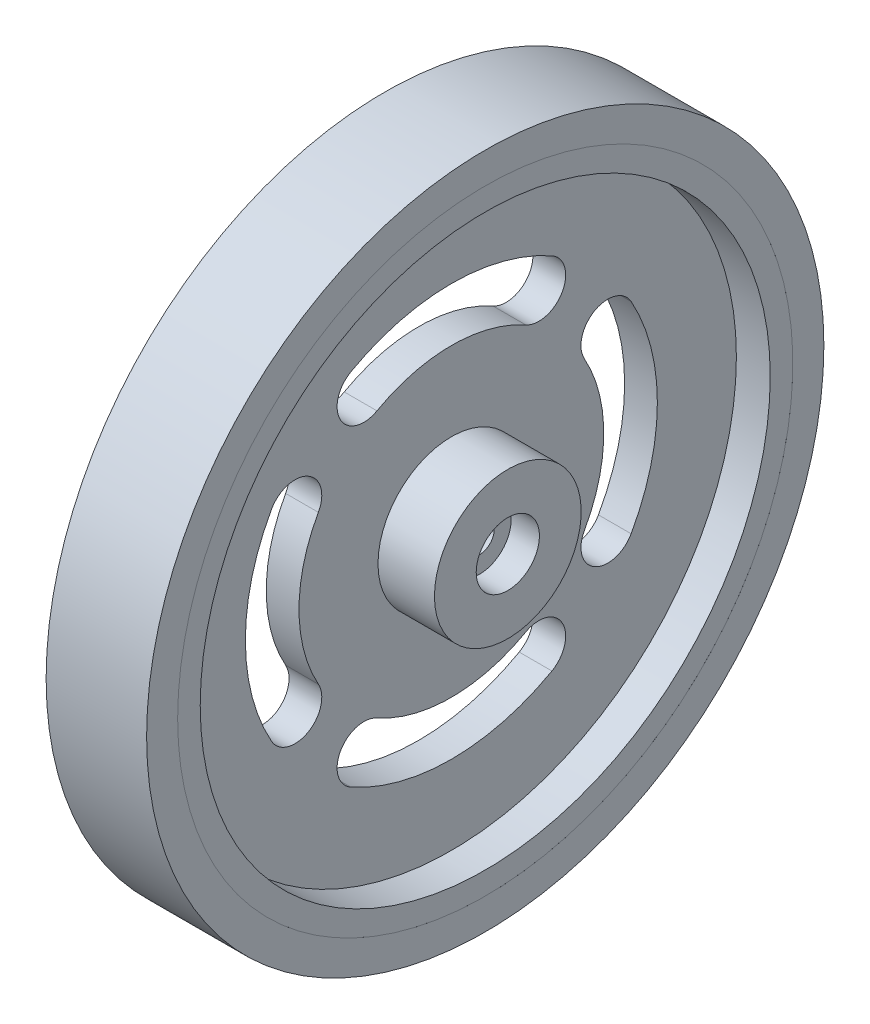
ISO-10303-21;
HEADER;
FILE_DESCRIPTION(('STEP AP214'),'2;1');
FILE_NAME('part.step','',(''),(''),'','','');
FILE_SCHEMA(('AUTOMOTIVE_DESIGN { 1 0 10303 214 1 1 1 1 }'));
ENDSEC;
DATA;
#1=APPLICATION_CONTEXT('core data for automotive mechanical design processes');
#2=APPLICATION_PROTOCOL_DEFINITION('international standard','automotive_design',2000,#1);
#3=PRODUCT_CONTEXT('',#1,'mechanical');
#4=PRODUCT('Part','Part','',(#3));
#5=PRODUCT_RELATED_PRODUCT_CATEGORY('part','',(#4));
#6=PRODUCT_DEFINITION_FORMATION('','',#4);
#7=PRODUCT_DEFINITION_CONTEXT('part definition',#1,'design');
#8=PRODUCT_DEFINITION('design','',#6,#7);
#9=PRODUCT_DEFINITION_SHAPE('','',#8);
#10=(LENGTH_UNIT() NAMED_UNIT(*) SI_UNIT(.MILLI.,.METRE.));
#11=(NAMED_UNIT(*) PLANE_ANGLE_UNIT() SI_UNIT($,.RADIAN.));
#12=(NAMED_UNIT(*) SI_UNIT($,.STERADIAN.) SOLID_ANGLE_UNIT());
#13=UNCERTAINTY_MEASURE_WITH_UNIT(LENGTH_MEASURE(1.E-05),#10,'distance_accuracy_value','');
#14=(GEOMETRIC_REPRESENTATION_CONTEXT(3) GLOBAL_UNCERTAINTY_ASSIGNED_CONTEXT((#13)) GLOBAL_UNIT_ASSIGNED_CONTEXT((#10,
#11,#12)) REPRESENTATION_CONTEXT('',''));
#15=CARTESIAN_POINT('',(0.,0.,0.));
#16=DIRECTION('',(0.,0.,1.));
#17=DIRECTION('',(1.,0.,0.));
#18=AXIS2_PLACEMENT_3D('',#15,#16,#17);
#19=CARTESIAN_POINT('',(-3.,0.,0.));
#20=DIRECTION('',(-1.,0.,0.));
#21=DIRECTION('',(0.,0.,1.));
#22=AXIS2_PLACEMENT_3D('',#19,#20,#21);
#23=CYLINDRICAL_SURFACE('',#22,1.3);
#24=CARTESIAN_POINT('',(5.4,0.,0.));
#25=DIRECTION('',(-1.,0.,0.));
#26=DIRECTION('',(0.,0.,1.));
#27=AXIS2_PLACEMENT_3D('',#24,#25,#26);
#28=CIRCLE('',#27,1.3);
#29=CARTESIAN_POINT('',(5.4,0.,1.3));
#30=VERTEX_POINT('',#29);
#31=EDGE_CURVE('E11',#30,#30,#28,.T.);
#32=ORIENTED_EDGE('',*,*,#31,.F.);
#33=EDGE_LOOP('',(#32));
#34=FACE_BOUND('',#33,.T.);
#35=CARTESIAN_POINT('',(1.2,0.,0.));
#36=DIRECTION('',(-1.,0.,0.));
#37=DIRECTION('',(0.,0.,1.));
#38=AXIS2_PLACEMENT_3D('',#35,#36,#37);
#39=CIRCLE('',#38,1.3);
#40=CARTESIAN_POINT('',(1.2,0.,1.3));
#41=VERTEX_POINT('',#40);
#42=EDGE_CURVE('E40',#41,#41,#39,.T.);
#43=ORIENTED_EDGE('',*,*,#42,.T.);
#44=EDGE_LOOP('',(#43));
#45=FACE_BOUND('',#44,.T.);
#46=ADVANCED_FACE('F37',(#34,#45),#23,.F.);
#47=CARTESIAN_POINT('',(0.,-8.37082020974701,0.));
#48=DIRECTION('',(-1.,0.,0.));
#49=DIRECTION('',(0.,0.,1.));
#50=AXIS2_PLACEMENT_3D('',#47,#48,#49);
#51=PLANE('',#50);
#52=CARTESIAN_POINT('',(0.,-7.75,-13.8547149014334));
#53=DIRECTION('',(-1.,0.,0.));
#54=DIRECTION('',(0.,0.,1.));
#55=AXIS2_PLACEMENT_3D('',#52,#53,#54);
#56=CIRCLE('',#55,2.375);
#57=CARTESIAN_POINT('',(0.,-8.90944881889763,-15.9274675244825));
#58=VERTEX_POINT('',#57);
#59=CARTESIAN_POINT('',(0.,-6.59055118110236,-11.7819622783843));
#60=VERTEX_POINT('',#59);
#61=EDGE_CURVE('E60',#58,#60,#56,.T.);
#62=ORIENTED_EDGE('',*,*,#61,.F.);
#63=CARTESIAN_POINT('',(0.,0.,0.));
#64=DIRECTION('',(-1.,0.,0.));
#65=DIRECTION('',(0.,0.,1.));
#66=AXIS2_PLACEMENT_3D('',#63,#64,#65);
#67=CIRCLE('',#66,18.25);
#68=CARTESIAN_POINT('',(0.,8.90944881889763,-15.9274675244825));
#69=VERTEX_POINT('',#68);
#70=EDGE_CURVE('E229',#69,#58,#67,.T.);
#71=ORIENTED_EDGE('',*,*,#70,.F.);
#72=CARTESIAN_POINT('',(0.,7.75,-13.8547149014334));
#73=DIRECTION('',(-1.,0.,0.));
#74=DIRECTION('',(0.,0.,1.));
#75=AXIS2_PLACEMENT_3D('',#72,#73,#74);
#76=CIRCLE('',#75,2.375);
#77=CARTESIAN_POINT('',(0.,6.59055118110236,-11.7819622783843));
#78=VERTEX_POINT('',#77);
#79=EDGE_CURVE('E226',#78,#69,#76,.T.);
#80=ORIENTED_EDGE('',*,*,#79,.F.);
#81=CARTESIAN_POINT('',(0.,0.,0.));
#82=DIRECTION('',(1.,0.,0.));
#83=DIRECTION('',(0.,0.,1.));
#84=AXIS2_PLACEMENT_3D('',#81,#82,#83);
#85=CIRCLE('',#84,13.5);
#86=EDGE_CURVE('E224',#60,#78,#85,.T.);
#87=ORIENTED_EDGE('',*,*,#86,.F.);
#88=EDGE_LOOP('',(#62,#71,#80,#87));
#89=FACE_BOUND('',#88,.T.);
#90=CARTESIAN_POINT('',(0.,-13.8547149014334,7.75));
#91=DIRECTION('',(-1.,0.,0.));
#92=DIRECTION('',(0.,0.,1.));
#93=AXIS2_PLACEMENT_3D('',#90,#91,#92);
#94=CIRCLE('',#93,2.375);
#95=CARTESIAN_POINT('',(0.,-15.9274675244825,8.90944881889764));
#96=VERTEX_POINT('',#95);
#97=CARTESIAN_POINT('',(0.,-11.7819622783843,6.59055118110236));
#98=VERTEX_POINT('',#97);
#99=EDGE_CURVE('E247',#96,#98,#94,.T.);
#100=ORIENTED_EDGE('',*,*,#99,.F.);
#101=CARTESIAN_POINT('',(0.,0.,0.));
#102=DIRECTION('',(-1.,0.,0.));
#103=DIRECTION('',(0.,0.,1.));
#104=AXIS2_PLACEMENT_3D('',#101,#102,#103);
#105=CIRCLE('',#104,18.25);
#106=CARTESIAN_POINT('',(0.,-15.9274675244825,-8.90944881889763));
#107=VERTEX_POINT('',#106);
#108=EDGE_CURVE('E255',#107,#96,#105,.T.);
#109=ORIENTED_EDGE('',*,*,#108,.F.);
#110=CARTESIAN_POINT('',(0.,-13.8547149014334,-7.75));
#111=DIRECTION('',(-1.,0.,0.));
#112=DIRECTION('',(0.,0.,1.));
#113=AXIS2_PLACEMENT_3D('',#110,#111,#112);
#114=CIRCLE('',#113,2.375);
#115=CARTESIAN_POINT('',(0.,-11.7819622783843,-6.59055118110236));
#116=VERTEX_POINT('',#115);
#117=EDGE_CURVE('E252',#116,#107,#114,.T.);
#118=ORIENTED_EDGE('',*,*,#117,.F.);
#119=CARTESIAN_POINT('',(0.,0.,0.));
#120=DIRECTION('',(1.,0.,0.));
#121=DIRECTION('',(0.,0.,1.));
#122=AXIS2_PLACEMENT_3D('',#119,#120,#121);
#123=CIRCLE('',#122,13.5);
#124=EDGE_CURVE('E249',#98,#116,#123,.T.);
#125=ORIENTED_EDGE('',*,*,#124,.F.);
#126=EDGE_LOOP('',(#100,#109,#118,#125));
#127=FACE_BOUND('',#126,.T.);
#128=CARTESIAN_POINT('',(0.,7.75,13.8547149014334));
#129=DIRECTION('',(-1.,0.,0.));
#130=DIRECTION('',(0.,0.,1.));
#131=AXIS2_PLACEMENT_3D('',#128,#129,#130);
#132=CIRCLE('',#131,2.375);
#133=CARTESIAN_POINT('',(0.,8.90944881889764,15.9274675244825));
#134=VERTEX_POINT('',#133);
#135=CARTESIAN_POINT('',(0.,6.59055118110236,11.7819622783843));
#136=VERTEX_POINT('',#135);
#137=EDGE_CURVE('E276',#134,#136,#132,.T.);
#138=ORIENTED_EDGE('',*,*,#137,.F.);
#139=CARTESIAN_POINT('',(0.,0.,0.));
#140=DIRECTION('',(-1.,0.,0.));
#141=DIRECTION('',(0.,0.,1.));
#142=AXIS2_PLACEMENT_3D('',#139,#140,#141);
#143=CIRCLE('',#142,18.25);
#144=CARTESIAN_POINT('',(0.,-8.90944881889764,15.9274675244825));
#145=VERTEX_POINT('',#144);
#146=EDGE_CURVE('E284',#145,#134,#143,.T.);
#147=ORIENTED_EDGE('',*,*,#146,.F.);
#148=CARTESIAN_POINT('',(0.,-7.75,13.8547149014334));
#149=DIRECTION('',(-1.,0.,0.));
#150=DIRECTION('',(0.,0.,1.));
#151=AXIS2_PLACEMENT_3D('',#148,#149,#150);
#152=CIRCLE('',#151,2.375);
#153=CARTESIAN_POINT('',(0.,-6.59055118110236,11.7819622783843));
#154=VERTEX_POINT('',#153);
#155=EDGE_CURVE('E281',#154,#145,#152,.T.);
#156=ORIENTED_EDGE('',*,*,#155,.F.);
#157=CARTESIAN_POINT('',(0.,0.,0.));
#158=DIRECTION('',(1.,0.,0.));
#159=DIRECTION('',(0.,0.,1.));
#160=AXIS2_PLACEMENT_3D('',#157,#158,#159);
#161=CIRCLE('',#160,13.5);
#162=EDGE_CURVE('E278',#136,#154,#161,.T.);
#163=ORIENTED_EDGE('',*,*,#162,.F.);
#164=EDGE_LOOP('',(#138,#147,#156,#163));
#165=FACE_BOUND('',#164,.T.);
#166=CARTESIAN_POINT('',(0.,13.8547149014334,-7.75));
#167=DIRECTION('',(-1.,0.,0.));
#168=DIRECTION('',(0.,0.,1.));
#169=AXIS2_PLACEMENT_3D('',#166,#167,#168);
#170=CIRCLE('',#169,2.375);
#171=CARTESIAN_POINT('',(0.,15.9274675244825,-8.90944881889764));
#172=VERTEX_POINT('',#171);
#173=CARTESIAN_POINT('',(0.,11.7819622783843,-6.59055118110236));
#174=VERTEX_POINT('',#173);
#175=EDGE_CURVE('E305',#172,#174,#170,.T.);
#176=ORIENTED_EDGE('',*,*,#175,.F.);
#177=CARTESIAN_POINT('',(0.,0.,0.));
#178=DIRECTION('',(-1.,0.,0.));
#179=DIRECTION('',(0.,0.,1.));
#180=AXIS2_PLACEMENT_3D('',#177,#178,#179);
#181=CIRCLE('',#180,18.25);
#182=CARTESIAN_POINT('',(0.,15.9274675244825,8.90944881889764));
#183=VERTEX_POINT('',#182);
#184=EDGE_CURVE('E313',#183,#172,#181,.T.);
#185=ORIENTED_EDGE('',*,*,#184,.F.);
#186=CARTESIAN_POINT('',(0.,13.8547149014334,7.75));
#187=DIRECTION('',(-1.,0.,0.));
#188=DIRECTION('',(0.,0.,1.));
#189=AXIS2_PLACEMENT_3D('',#186,#187,#188);
#190=CIRCLE('',#189,2.375);
#191=CARTESIAN_POINT('',(0.,11.7819622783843,6.59055118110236));
#192=VERTEX_POINT('',#191);
#193=EDGE_CURVE('E310',#192,#183,#190,.T.);
#194=ORIENTED_EDGE('',*,*,#193,.F.);
#195=CARTESIAN_POINT('',(0.,0.,0.));
#196=DIRECTION('',(1.,0.,0.));
#197=DIRECTION('',(0.,0.,1.));
#198=AXIS2_PLACEMENT_3D('',#195,#196,#197);
#199=CIRCLE('',#198,13.5);
#200=EDGE_CURVE('E307',#174,#192,#199,.T.);
#201=ORIENTED_EDGE('',*,*,#200,.F.);
#202=EDGE_LOOP('',(#176,#185,#194,#201));
#203=FACE_BOUND('',#202,.T.);
#204=CARTESIAN_POINT('',(0.,0.,0.));
#205=DIRECTION('',(-1.,0.,0.));
#206=DIRECTION('',(0.,0.,1.));
#207=AXIS2_PLACEMENT_3D('',#204,#205,#206);
#208=CIRCLE('',#207,25.25);
#209=CARTESIAN_POINT('',(0.,0.,25.25));
#210=VERTEX_POINT('',#209);
#211=EDGE_CURVE('E334',#210,#210,#208,.T.);
#212=ORIENTED_EDGE('',*,*,#211,.T.);
#213=EDGE_LOOP('',(#212));
#214=FACE_BOUND('',#213,.T.);
#215=CARTESIAN_POINT('',(0.,0.,0.));
#216=DIRECTION('',(-1.,0.,0.));
#217=DIRECTION('',(0.,0.,1.));
#218=AXIS2_PLACEMENT_3D('',#215,#216,#217);
#219=CIRCLE('',#218,4.5);
#220=CARTESIAN_POINT('',(0.,0.,4.5));
#221=VERTEX_POINT('',#220);
#222=EDGE_CURVE('E186',#221,#221,#219,.T.);
#223=ORIENTED_EDGE('',*,*,#222,.F.);
#224=EDGE_LOOP('',(#223));
#225=FACE_BOUND('',#224,.T.);
#226=ADVANCED_FACE('F380',(#89,#127,#165,#203,#214,#225),#51,.T.);
#227=CARTESIAN_POINT('',(5.4,-8.370820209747,0.));
#228=DIRECTION('',(1.,0.,0.));
#229=DIRECTION('',(0.,0.,-1.));
#230=AXIS2_PLACEMENT_3D('',#227,#228,#229);
#231=PLANE('',#230);
#232=ORIENTED_EDGE('',*,*,#31,.T.);
#233=EDGE_LOOP('',(#232));
#234=FACE_BOUND('',#233,.T.);
#235=CARTESIAN_POINT('',(5.4,0.,0.));
#236=DIRECTION('',(-1.,0.,0.));
#237=DIRECTION('',(0.,0.,1.));
#238=AXIS2_PLACEMENT_3D('',#235,#236,#237);
#239=CIRCLE('',#238,2.8);
#240=CARTESIAN_POINT('',(5.4,0.,2.8));
#241=VERTEX_POINT('',#240);
#242=EDGE_CURVE('E45',#241,#241,#239,.T.);
#243=ORIENTED_EDGE('',*,*,#242,.F.);
#244=EDGE_LOOP('',(#243));
#245=FACE_BOUND('',#244,.T.);
#246=ADVANCED_FACE('F378',(#234,#245),#231,.T.);
#247=CARTESIAN_POINT('',(-3.,0.,0.));
#248=DIRECTION('',(-1.,0.,0.));
#249=DIRECTION('',(0.,0.,1.));
#250=AXIS2_PLACEMENT_3D('',#247,#248,#249);
#251=CYLINDRICAL_SURFACE('',#250,2.8);
#252=CARTESIAN_POINT('',(7.9,0.,0.));
#253=DIRECTION('',(-1.,0.,0.));
#254=DIRECTION('',(0.,0.,1.));
#255=AXIS2_PLACEMENT_3D('',#252,#253,#254);
#256=CIRCLE('',#255,2.8);
#257=CARTESIAN_POINT('',(7.9,0.,2.8));
#258=VERTEX_POINT('',#257);
#259=EDGE_CURVE('E370',#258,#258,#256,.T.);
#260=ORIENTED_EDGE('',*,*,#259,.F.);
#261=EDGE_LOOP('',(#260));
#262=FACE_BOUND('',#261,.T.);
#263=ORIENTED_EDGE('',*,*,#242,.T.);
#264=EDGE_LOOP('',(#263));
#265=FACE_BOUND('',#264,.T.);
#266=ADVANCED_FACE('F376',(#262,#265),#251,.F.);
#267=CARTESIAN_POINT('',(7.9,-8.37082020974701,0.));
#268=DIRECTION('',(1.,0.,0.));
#269=DIRECTION('',(0.,0.,-1.));
#270=AXIS2_PLACEMENT_3D('',#267,#268,#269);
#271=PLANE('',#270);
#272=ORIENTED_EDGE('',*,*,#259,.T.);
#273=EDGE_LOOP('',(#272));
#274=FACE_BOUND('',#273,.T.);
#275=CARTESIAN_POINT('',(7.9,0.,0.));
#276=DIRECTION('',(-1.,0.,0.));
#277=DIRECTION('',(0.,0.,1.));
#278=AXIS2_PLACEMENT_3D('',#275,#276,#277);
#279=CIRCLE('',#278,6.5);
#280=CARTESIAN_POINT('',(7.9,0.,6.5));
#281=VERTEX_POINT('',#280);
#282=EDGE_CURVE('E367',#281,#281,#279,.T.);
#283=ORIENTED_EDGE('',*,*,#282,.F.);
#284=EDGE_LOOP('',(#283));
#285=FACE_BOUND('',#284,.T.);
#286=ADVANCED_FACE('F385',(#274,#285),#271,.T.);
#287=CARTESIAN_POINT('',(-3.,0.,0.));
#288=DIRECTION('',(-1.,0.,0.));
#289=DIRECTION('',(0.,0.,1.));
#290=AXIS2_PLACEMENT_3D('',#287,#288,#289);
#291=CYLINDRICAL_SURFACE('',#290,6.5);
#292=ORIENTED_EDGE('',*,*,#282,.T.);
#293=EDGE_LOOP('',(#292));
#294=FACE_BOUND('',#293,.T.);
#295=CARTESIAN_POINT('',(2.9,0.,0.));
#296=DIRECTION('',(-1.,0.,0.));
#297=DIRECTION('',(0.,0.,1.));
#298=AXIS2_PLACEMENT_3D('',#295,#296,#297);
#299=CIRCLE('',#298,6.5);
#300=CARTESIAN_POINT('',(2.9,0.,6.5));
#301=VERTEX_POINT('',#300);
#302=EDGE_CURVE('E364',#301,#301,#299,.T.);
#303=ORIENTED_EDGE('',*,*,#302,.F.);
#304=EDGE_LOOP('',(#303));
#305=FACE_BOUND('',#304,.T.);
#306=ADVANCED_FACE('F523',(#294,#305),#291,.T.);
#307=CARTESIAN_POINT('',(2.9,-8.37082020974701,0.));
#308=DIRECTION('',(1.,0.,0.));
#309=DIRECTION('',(0.,0.,-1.));
#310=AXIS2_PLACEMENT_3D('',#307,#308,#309);
#311=PLANE('',#310);
#312=CARTESIAN_POINT('',(2.9,-7.75,-13.8547149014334));
#313=DIRECTION('',(1.,0.,0.));
#314=DIRECTION('',(0.,0.,-1.));
#315=AXIS2_PLACEMENT_3D('',#312,#313,#314);
#316=CIRCLE('',#315,2.375);
#317=CARTESIAN_POINT('',(2.9,-6.59055118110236,-11.7819622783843));
#318=VERTEX_POINT('',#317);
#319=CARTESIAN_POINT('',(2.9,-8.90944881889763,-15.9274675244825));
#320=VERTEX_POINT('',#319);
#321=EDGE_CURVE('E245',#318,#320,#316,.T.);
#322=ORIENTED_EDGE('',*,*,#321,.F.);
#323=CARTESIAN_POINT('',(2.9,0.,0.));
#324=DIRECTION('',(1.,0.,0.));
#325=DIRECTION('',(0.,0.,-1.));
#326=AXIS2_PLACEMENT_3D('',#323,#324,#325);
#327=CIRCLE('',#326,13.5);
#328=CARTESIAN_POINT('',(2.9,6.59055118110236,-11.7819622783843));
#329=VERTEX_POINT('',#328);
#330=EDGE_CURVE('E235',#329,#318,#327,.F.);
#331=ORIENTED_EDGE('',*,*,#330,.F.);
#332=CARTESIAN_POINT('',(2.9,7.75,-13.8547149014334));
#333=DIRECTION('',(1.,0.,0.));
#334=DIRECTION('',(0.,0.,-1.));
#335=AXIS2_PLACEMENT_3D('',#332,#333,#334);
#336=CIRCLE('',#335,2.375);
#337=CARTESIAN_POINT('',(2.9,8.90944881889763,-15.9274675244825));
#338=VERTEX_POINT('',#337);
#339=EDGE_CURVE('E241',#338,#329,#336,.T.);
#340=ORIENTED_EDGE('',*,*,#339,.F.);
#341=CARTESIAN_POINT('',(2.9,0.,0.));
#342=DIRECTION('',(1.,0.,0.));
#343=DIRECTION('',(0.,0.,-1.));
#344=AXIS2_PLACEMENT_3D('',#341,#342,#343);
#345=CIRCLE('',#344,18.25);
#346=EDGE_CURVE('E243',#320,#338,#345,.T.);
#347=ORIENTED_EDGE('',*,*,#346,.F.);
#348=EDGE_LOOP('',(#322,#331,#340,#347));
#349=FACE_BOUND('',#348,.T.);
#350=CARTESIAN_POINT('',(2.9,-13.8547149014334,7.75));
#351=DIRECTION('',(1.,0.,0.));
#352=DIRECTION('',(0.,0.,-1.));
#353=AXIS2_PLACEMENT_3D('',#350,#351,#352);
#354=CIRCLE('',#353,2.375);
#355=CARTESIAN_POINT('',(2.9,-11.7819622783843,6.59055118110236));
#356=VERTEX_POINT('',#355);
#357=CARTESIAN_POINT('',(2.9,-15.9274675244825,8.90944881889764));
#358=VERTEX_POINT('',#357);
#359=EDGE_CURVE('E274',#356,#358,#354,.T.);
#360=ORIENTED_EDGE('',*,*,#359,.F.);
#361=CARTESIAN_POINT('',(2.9,0.,0.));
#362=DIRECTION('',(1.,0.,0.));
#363=DIRECTION('',(0.,0.,-1.));
#364=AXIS2_PLACEMENT_3D('',#361,#362,#363);
#365=CIRCLE('',#364,13.5);
#366=CARTESIAN_POINT('',(2.9,-11.7819622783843,-6.59055118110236));
#367=VERTEX_POINT('',#366);
#368=EDGE_CURVE('E261',#367,#356,#365,.F.);
#369=ORIENTED_EDGE('',*,*,#368,.F.);
#370=CARTESIAN_POINT('',(2.9,-13.8547149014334,-7.75));
#371=DIRECTION('',(1.,0.,0.));
#372=DIRECTION('',(0.,0.,-1.));
#373=AXIS2_PLACEMENT_3D('',#370,#371,#372);
#374=CIRCLE('',#373,2.375);
#375=CARTESIAN_POINT('',(2.9,-15.9274675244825,-8.90944881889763));
#376=VERTEX_POINT('',#375);
#377=EDGE_CURVE('E269',#376,#367,#374,.T.);
#378=ORIENTED_EDGE('',*,*,#377,.F.);
#379=CARTESIAN_POINT('',(2.9,0.,0.));
#380=DIRECTION('',(1.,0.,0.));
#381=DIRECTION('',(0.,0.,-1.));
#382=AXIS2_PLACEMENT_3D('',#379,#380,#381);
#383=CIRCLE('',#382,18.25);
#384=EDGE_CURVE('E272',#358,#376,#383,.T.);
#385=ORIENTED_EDGE('',*,*,#384,.F.);
#386=EDGE_LOOP('',(#360,#369,#378,#385));
#387=FACE_BOUND('',#386,.T.);
#388=CARTESIAN_POINT('',(2.9,7.75,13.8547149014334));
#389=DIRECTION('',(1.,0.,0.));
#390=DIRECTION('',(0.,0.,-1.));
#391=AXIS2_PLACEMENT_3D('',#388,#389,#390);
#392=CIRCLE('',#391,2.375);
#393=CARTESIAN_POINT('',(2.9,6.59055118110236,11.7819622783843));
#394=VERTEX_POINT('',#393);
#395=CARTESIAN_POINT('',(2.9,8.90944881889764,15.9274675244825));
#396=VERTEX_POINT('',#395);
#397=EDGE_CURVE('E303',#394,#396,#392,.T.);
#398=ORIENTED_EDGE('',*,*,#397,.F.);
#399=CARTESIAN_POINT('',(2.9,0.,0.));
#400=DIRECTION('',(1.,0.,0.));
#401=DIRECTION('',(0.,0.,-1.));
#402=AXIS2_PLACEMENT_3D('',#399,#400,#401);
#403=CIRCLE('',#402,13.5);
#404=CARTESIAN_POINT('',(2.9,-6.59055118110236,11.7819622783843));
#405=VERTEX_POINT('',#404);
#406=EDGE_CURVE('E290',#405,#394,#403,.F.);
#407=ORIENTED_EDGE('',*,*,#406,.F.);
#408=CARTESIAN_POINT('',(2.9,-7.75,13.8547149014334));
#409=DIRECTION('',(1.,0.,0.));
#410=DIRECTION('',(0.,0.,-1.));
#411=AXIS2_PLACEMENT_3D('',#408,#409,#410);
#412=CIRCLE('',#411,2.375);
#413=CARTESIAN_POINT('',(2.9,-8.90944881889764,15.9274675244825));
#414=VERTEX_POINT('',#413);
#415=EDGE_CURVE('E298',#414,#405,#412,.T.);
#416=ORIENTED_EDGE('',*,*,#415,.F.);
#417=CARTESIAN_POINT('',(2.9,0.,0.));
#418=DIRECTION('',(1.,0.,0.));
#419=DIRECTION('',(0.,0.,-1.));
#420=AXIS2_PLACEMENT_3D('',#417,#418,#419);
#421=CIRCLE('',#420,18.25);
#422=EDGE_CURVE('E301',#396,#414,#421,.T.);
#423=ORIENTED_EDGE('',*,*,#422,.F.);
#424=EDGE_LOOP('',(#398,#407,#416,#423));
#425=FACE_BOUND('',#424,.T.);
#426=CARTESIAN_POINT('',(2.9,13.8547149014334,-7.75));
#427=DIRECTION('',(1.,0.,0.));
#428=DIRECTION('',(0.,0.,-1.));
#429=AXIS2_PLACEMENT_3D('',#426,#427,#428);
#430=CIRCLE('',#429,2.375);
#431=CARTESIAN_POINT('',(2.9,11.7819622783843,-6.59055118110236));
#432=VERTEX_POINT('',#431);
#433=CARTESIAN_POINT('',(2.9,15.9274675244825,-8.90944881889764));
#434=VERTEX_POINT('',#433);
#435=EDGE_CURVE('E332',#432,#434,#430,.T.);
#436=ORIENTED_EDGE('',*,*,#435,.F.);
#437=CARTESIAN_POINT('',(2.9,0.,0.));
#438=DIRECTION('',(1.,0.,0.));
#439=DIRECTION('',(0.,0.,-1.));
#440=AXIS2_PLACEMENT_3D('',#437,#438,#439);
#441=CIRCLE('',#440,13.5);
#442=CARTESIAN_POINT('',(2.9,11.7819622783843,6.59055118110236));
#443=VERTEX_POINT('',#442);
#444=EDGE_CURVE('E319',#443,#432,#441,.F.);
#445=ORIENTED_EDGE('',*,*,#444,.F.);
#446=CARTESIAN_POINT('',(2.9,13.8547149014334,7.75));
#447=DIRECTION('',(1.,0.,0.));
#448=DIRECTION('',(0.,0.,-1.));
#449=AXIS2_PLACEMENT_3D('',#446,#447,#448);
#450=CIRCLE('',#449,2.375);
#451=CARTESIAN_POINT('',(2.9,15.9274675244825,8.90944881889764));
#452=VERTEX_POINT('',#451);
#453=EDGE_CURVE('E327',#452,#443,#450,.T.);
#454=ORIENTED_EDGE('',*,*,#453,.F.);
#455=CARTESIAN_POINT('',(2.9,0.,0.));
#456=DIRECTION('',(1.,0.,0.));
#457=DIRECTION('',(0.,0.,-1.));
#458=AXIS2_PLACEMENT_3D('',#455,#456,#457);
#459=CIRCLE('',#458,18.25);
#460=EDGE_CURVE('E330',#434,#452,#459,.T.);
#461=ORIENTED_EDGE('',*,*,#460,.F.);
#462=EDGE_LOOP('',(#436,#445,#454,#461));
#463=FACE_BOUND('',#462,.T.);
#464=ORIENTED_EDGE('',*,*,#302,.T.);
#465=EDGE_LOOP('',(#464));
#466=FACE_BOUND('',#465,.T.);
#467=CARTESIAN_POINT('',(2.9,0.,0.));
#468=DIRECTION('',(-1.,0.,0.));
#469=DIRECTION('',(0.,0.,1.));
#470=AXIS2_PLACEMENT_3D('',#467,#468,#469);
#471=CIRCLE('',#470,25.25);
#472=CARTESIAN_POINT('',(2.9,0.,25.25));
#473=VERTEX_POINT('',#472);
#474=EDGE_CURVE('E361',#473,#473,#471,.T.);
#475=ORIENTED_EDGE('',*,*,#474,.F.);
#476=EDGE_LOOP('',(#475));
#477=FACE_BOUND('',#476,.T.);
#478=ADVANCED_FACE('F519',(#349,#387,#425,#463,#466,#477),#311,.T.);
#479=CARTESIAN_POINT('',(-3.,0.,0.));
#480=DIRECTION('',(-1.,0.,0.));
#481=DIRECTION('',(0.,0.,1.));
#482=AXIS2_PLACEMENT_3D('',#479,#480,#481);
#483=CYLINDRICAL_SURFACE('',#482,25.25);
#484=ORIENTED_EDGE('',*,*,#474,.T.);
#485=EDGE_LOOP('',(#484));
#486=FACE_BOUND('',#485,.T.);
#487=CARTESIAN_POINT('',(5.9,0.,0.));
#488=DIRECTION('',(-1.,0.,0.));
#489=DIRECTION('',(0.,0.,1.));
#490=AXIS2_PLACEMENT_3D('',#487,#488,#489);
#491=CIRCLE('',#490,25.25);
#492=CARTESIAN_POINT('',(5.9,0.,25.25));
#493=VERTEX_POINT('',#492);
#494=EDGE_CURVE('E358',#493,#493,#491,.T.);
#495=ORIENTED_EDGE('',*,*,#494,.F.);
#496=EDGE_LOOP('',(#495));
#497=FACE_BOUND('',#496,.T.);
#498=ADVANCED_FACE('F515',(#486,#497),#483,.F.);
#499=CARTESIAN_POINT('',(5.9,-8.37082020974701,0.));
#500=DIRECTION('',(1.,0.,0.));
#501=DIRECTION('',(0.,0.,-1.));
#502=AXIS2_PLACEMENT_3D('',#499,#500,#501);
#503=PLANE('',#502);
#504=ORIENTED_EDGE('',*,*,#494,.T.);
#505=EDGE_LOOP('',(#504));
#506=FACE_BOUND('',#505,.T.);
#507=CARTESIAN_POINT('',(5.9,0.,0.));
#508=DIRECTION('',(-1.,0.,0.));
#509=DIRECTION('',(0.,0.,1.));
#510=AXIS2_PLACEMENT_3D('',#507,#508,#509);
#511=CIRCLE('',#510,27.25);
#512=CARTESIAN_POINT('',(5.9,0.,27.25));
#513=VERTEX_POINT('',#512);
#514=EDGE_CURVE('E355',#513,#513,#511,.T.);
#515=ORIENTED_EDGE('',*,*,#514,.F.);
#516=EDGE_LOOP('',(#515));
#517=FACE_BOUND('',#516,.T.);
#518=ADVANCED_FACE('F512',(#506,#517),#503,.T.);
#519=CARTESIAN_POINT('',(-3.,0.,0.));
#520=DIRECTION('',(-1.,0.,0.));
#521=DIRECTION('',(0.,0.,1.));
#522=AXIS2_PLACEMENT_3D('',#519,#520,#521);
#523=CYLINDRICAL_SURFACE('',#522,27.25);
#524=ORIENTED_EDGE('',*,*,#514,.T.);
#525=EDGE_LOOP('',(#524));
#526=FACE_BOUND('',#525,.T.);
#527=CARTESIAN_POINT('',(5.901,0.,0.));
#528=DIRECTION('',(-1.,0.,0.));
#529=DIRECTION('',(0.,0.,1.));
#530=AXIS2_PLACEMENT_3D('',#527,#528,#529);
#531=CIRCLE('',#530,27.25);
#532=CARTESIAN_POINT('',(5.901,0.,27.25));
#533=VERTEX_POINT('',#532);
#534=EDGE_CURVE('E352',#533,#533,#531,.T.);
#535=ORIENTED_EDGE('',*,*,#534,.F.);
#536=EDGE_LOOP('',(#535));
#537=FACE_BOUND('',#536,.T.);
#538=ADVANCED_FACE('F500',(#526,#537),#523,.F.);
#539=CARTESIAN_POINT('',(5.901,-8.37082020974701,0.));
#540=DIRECTION('',(1.,0.,0.));
#541=DIRECTION('',(0.,0.,-1.));
#542=AXIS2_PLACEMENT_3D('',#539,#540,#541);
#543=PLANE('',#542);
#544=ORIENTED_EDGE('',*,*,#534,.T.);
#545=EDGE_LOOP('',(#544));
#546=FACE_BOUND('',#545,.T.);
#547=CARTESIAN_POINT('',(5.901,0.,0.));
#548=DIRECTION('',(-1.,0.,0.));
#549=DIRECTION('',(0.,0.,1.));
#550=AXIS2_PLACEMENT_3D('',#547,#548,#549);
#551=CIRCLE('',#550,30.);
#552=CARTESIAN_POINT('',(5.901,0.,30.));
#553=VERTEX_POINT('',#552);
#554=EDGE_CURVE('E349',#553,#553,#551,.T.);
#555=ORIENTED_EDGE('',*,*,#554,.F.);
#556=EDGE_LOOP('',(#555));
#557=FACE_BOUND('',#556,.T.);
#558=ADVANCED_FACE('F507',(#546,#557),#543,.T.);
#559=CARTESIAN_POINT('',(-3.,0.,0.));
#560=DIRECTION('',(-1.,0.,0.));
#561=DIRECTION('',(0.,0.,1.));
#562=AXIS2_PLACEMENT_3D('',#559,#560,#561);
#563=CYLINDRICAL_SURFACE('',#562,30.);
#564=ORIENTED_EDGE('',*,*,#554,.T.);
#565=EDGE_LOOP('',(#564));
#566=FACE_BOUND('',#565,.T.);
#567=CARTESIAN_POINT('',(-3.001,0.,0.));
#568=DIRECTION('',(-1.,0.,0.));
#569=DIRECTION('',(0.,0.,1.));
#570=AXIS2_PLACEMENT_3D('',#567,#568,#569);
#571=CIRCLE('',#570,30.);
#572=CARTESIAN_POINT('',(-3.001,0.,30.));
#573=VERTEX_POINT('',#572);
#574=EDGE_CURVE('E346',#573,#573,#571,.T.);
#575=ORIENTED_EDGE('',*,*,#574,.F.);
#576=EDGE_LOOP('',(#575));
#577=FACE_BOUND('',#576,.T.);
#578=ADVANCED_FACE('F503',(#566,#577),#563,.T.);
#579=CARTESIAN_POINT('',(-3.001,-8.37082020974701,0.));
#580=DIRECTION('',(-1.,0.,0.));
#581=DIRECTION('',(0.,0.,1.));
#582=AXIS2_PLACEMENT_3D('',#579,#580,#581);
#583=PLANE('',#582);
#584=ORIENTED_EDGE('',*,*,#574,.T.);
#585=EDGE_LOOP('',(#584));
#586=FACE_BOUND('',#585,.T.);
#587=CARTESIAN_POINT('',(-3.001,0.,0.));
#588=DIRECTION('',(-1.,0.,0.));
#589=DIRECTION('',(0.,0.,1.));
#590=AXIS2_PLACEMENT_3D('',#587,#588,#589);
#591=CIRCLE('',#590,27.25);
#592=CARTESIAN_POINT('',(-3.001,0.,27.25));
#593=VERTEX_POINT('',#592);
#594=EDGE_CURVE('E343',#593,#593,#591,.T.);
#595=ORIENTED_EDGE('',*,*,#594,.F.);
#596=EDGE_LOOP('',(#595));
#597=FACE_BOUND('',#596,.T.);
#598=ADVANCED_FACE('F498',(#586,#597),#583,.T.);
#599=ORIENTED_EDGE('',*,*,#594,.T.);
#600=EDGE_LOOP('',(#599));
#601=FACE_BOUND('',#600,.T.);
#602=CARTESIAN_POINT('',(-3.,0.,0.));
#603=DIRECTION('',(-1.,0.,0.));
#604=DIRECTION('',(0.,0.,1.));
#605=AXIS2_PLACEMENT_3D('',#602,#603,#604);
#606=CIRCLE('',#605,27.25);
#607=CARTESIAN_POINT('',(-3.,0.,27.25));
#608=VERTEX_POINT('',#607);
#609=EDGE_CURVE('E340',#608,#608,#606,.T.);
#610=ORIENTED_EDGE('',*,*,#609,.F.);
#611=EDGE_LOOP('',(#610));
#612=FACE_BOUND('',#611,.T.);
#613=ADVANCED_FACE('F494',(#601,#612),#523,.F.);
#614=CARTESIAN_POINT('',(-3.,-8.37082020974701,0.));
#615=DIRECTION('',(-1.,0.,0.));
#616=DIRECTION('',(0.,0.,1.));
#617=AXIS2_PLACEMENT_3D('',#614,#615,#616);
#618=PLANE('',#617);
#619=ORIENTED_EDGE('',*,*,#609,.T.);
#620=EDGE_LOOP('',(#619));
#621=FACE_BOUND('',#620,.T.);
#622=CARTESIAN_POINT('',(-3.,0.,0.));
#623=DIRECTION('',(-1.,0.,0.));
#624=DIRECTION('',(0.,0.,1.));
#625=AXIS2_PLACEMENT_3D('',#622,#623,#624);
#626=CIRCLE('',#625,25.25);
#627=CARTESIAN_POINT('',(-3.,0.,25.25));
#628=VERTEX_POINT('',#627);
#629=EDGE_CURVE('E337',#628,#628,#626,.T.);
#630=ORIENTED_EDGE('',*,*,#629,.F.);
#631=EDGE_LOOP('',(#630));
#632=FACE_BOUND('',#631,.T.);
#633=ADVANCED_FACE('F490',(#621,#632),#618,.T.);
#634=CARTESIAN_POINT('',(-3.,0.,0.));
#635=DIRECTION('',(-1.,0.,0.));
#636=DIRECTION('',(0.,0.,1.));
#637=AXIS2_PLACEMENT_3D('',#634,#635,#636);
#638=CYLINDRICAL_SURFACE('',#637,25.25);
#639=ORIENTED_EDGE('',*,*,#629,.T.);
#640=EDGE_LOOP('',(#639));
#641=FACE_BOUND('',#640,.T.);
#642=ORIENTED_EDGE('',*,*,#211,.F.);
#643=EDGE_LOOP('',(#642));
#644=FACE_BOUND('',#643,.T.);
#645=ADVANCED_FACE('F485',(#641,#644),#638,.F.);
#646=CARTESIAN_POINT('',(10.,13.8547149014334,-7.75));
#647=DIRECTION('',(-1.,0.,0.));
#648=DIRECTION('',(0.,0.,1.));
#649=AXIS2_PLACEMENT_3D('',#646,#647,#648);
#650=CYLINDRICAL_SURFACE('',#649,2.375);
#651=ORIENTED_EDGE('',*,*,#435,.T.);
#652=DIRECTION('',(-1.,0.,0.));
#653=VECTOR('',#652,1.);
#654=CARTESIAN_POINT('',(10.,15.9274675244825,-8.90944881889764));
#655=LINE('',#654,#653);
#656=EDGE_CURVE('E317',#434,#172,#655,.T.);
#657=ORIENTED_EDGE('',*,*,#656,.T.);
#658=ORIENTED_EDGE('',*,*,#175,.T.);
#659=DIRECTION('',(-1.,0.,0.));
#660=VECTOR('',#659,1.);
#661=CARTESIAN_POINT('',(10.,11.7819622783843,-6.59055118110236));
#662=LINE('',#661,#660);
#663=EDGE_CURVE('E316',#432,#174,#662,.T.);
#664=ORIENTED_EDGE('',*,*,#663,.F.);
#665=EDGE_LOOP('',(#651,#657,#658,#664));
#666=FACE_BOUND('',#665,.T.);
#667=ADVANCED_FACE('F476',(#666),#650,.F.);
#668=CARTESIAN_POINT('',(10.,0.,0.));
#669=DIRECTION('',(-1.,0.,0.));
#670=DIRECTION('',(0.,0.,1.));
#671=AXIS2_PLACEMENT_3D('',#668,#669,#670);
#672=CYLINDRICAL_SURFACE('',#671,18.25);
#673=ORIENTED_EDGE('',*,*,#460,.T.);
#674=DIRECTION('',(-1.,0.,0.));
#675=VECTOR('',#674,1.);
#676=CARTESIAN_POINT('',(10.,15.9274675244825,8.90944881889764));
#677=LINE('',#676,#675);
#678=EDGE_CURVE('E320',#452,#183,#677,.T.);
#679=ORIENTED_EDGE('',*,*,#678,.T.);
#680=ORIENTED_EDGE('',*,*,#184,.T.);
#681=ORIENTED_EDGE('',*,*,#656,.F.);
#682=EDGE_LOOP('',(#673,#679,#680,#681));
#683=FACE_BOUND('',#682,.T.);
#684=ADVANCED_FACE('F472',(#683),#672,.F.);
#685=CARTESIAN_POINT('',(10.,13.8547149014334,7.75));
#686=DIRECTION('',(-1.,0.,0.));
#687=DIRECTION('',(0.,0.,1.));
#688=AXIS2_PLACEMENT_3D('',#685,#686,#687);
#689=CYLINDRICAL_SURFACE('',#688,2.375);
#690=ORIENTED_EDGE('',*,*,#453,.T.);
#691=DIRECTION('',(-1.,0.,0.));
#692=VECTOR('',#691,1.);
#693=CARTESIAN_POINT('',(10.,11.7819622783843,6.59055118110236));
#694=LINE('',#693,#692);
#695=EDGE_CURVE('E322',#443,#192,#694,.T.);
#696=ORIENTED_EDGE('',*,*,#695,.T.);
#697=ORIENTED_EDGE('',*,*,#193,.T.);
#698=ORIENTED_EDGE('',*,*,#678,.F.);
#699=EDGE_LOOP('',(#690,#696,#697,#698));
#700=FACE_BOUND('',#699,.T.);
#701=ADVANCED_FACE('F475',(#700),#689,.F.);
#702=CARTESIAN_POINT('',(10.,0.,0.));
#703=DIRECTION('',(-1.,0.,0.));
#704=DIRECTION('',(0.,0.,1.));
#705=AXIS2_PLACEMENT_3D('',#702,#703,#704);
#706=CYLINDRICAL_SURFACE('',#705,13.5);
#707=ORIENTED_EDGE('',*,*,#444,.T.);
#708=ORIENTED_EDGE('',*,*,#663,.T.);
#709=ORIENTED_EDGE('',*,*,#200,.T.);
#710=ORIENTED_EDGE('',*,*,#695,.F.);
#711=EDGE_LOOP('',(#707,#708,#709,#710));
#712=FACE_BOUND('',#711,.T.);
#713=ADVANCED_FACE('F470',(#712),#706,.T.);
#714=CARTESIAN_POINT('',(10.,7.75,13.8547149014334));
#715=DIRECTION('',(-1.,0.,0.));
#716=DIRECTION('',(0.,0.,1.));
#717=AXIS2_PLACEMENT_3D('',#714,#715,#716);
#718=CYLINDRICAL_SURFACE('',#717,2.375);
#719=ORIENTED_EDGE('',*,*,#397,.T.);
#720=DIRECTION('',(-1.,0.,0.));
#721=VECTOR('',#720,1.);
#722=CARTESIAN_POINT('',(10.,8.90944881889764,15.9274675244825));
#723=LINE('',#722,#721);
#724=EDGE_CURVE('E288',#396,#134,#723,.T.);
#725=ORIENTED_EDGE('',*,*,#724,.T.);
#726=ORIENTED_EDGE('',*,*,#137,.T.);
#727=DIRECTION('',(-1.,0.,0.));
#728=VECTOR('',#727,1.);
#729=CARTESIAN_POINT('',(10.,6.59055118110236,11.7819622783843));
#730=LINE('',#729,#728);
#731=EDGE_CURVE('E287',#394,#136,#730,.T.);
#732=ORIENTED_EDGE('',*,*,#731,.F.);
#733=EDGE_LOOP('',(#719,#725,#726,#732));
#734=FACE_BOUND('',#733,.T.);
#735=ADVANCED_FACE('F460',(#734),#718,.F.);
#736=CARTESIAN_POINT('',(10.,0.,0.));
#737=DIRECTION('',(-1.,0.,0.));
#738=DIRECTION('',(0.,0.,1.));
#739=AXIS2_PLACEMENT_3D('',#736,#737,#738);
#740=CYLINDRICAL_SURFACE('',#739,18.25);
#741=ORIENTED_EDGE('',*,*,#422,.T.);
#742=DIRECTION('',(-1.,0.,0.));
#743=VECTOR('',#742,1.);
#744=CARTESIAN_POINT('',(10.,-8.90944881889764,15.9274675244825));
#745=LINE('',#744,#743);
#746=EDGE_CURVE('E291',#414,#145,#745,.T.);
#747=ORIENTED_EDGE('',*,*,#746,.T.);
#748=ORIENTED_EDGE('',*,*,#146,.T.);
#749=ORIENTED_EDGE('',*,*,#724,.F.);
#750=EDGE_LOOP('',(#741,#747,#748,#749));
#751=FACE_BOUND('',#750,.T.);
#752=ADVANCED_FACE('F456',(#751),#740,.F.);
#753=CARTESIAN_POINT('',(10.,-7.75,13.8547149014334));
#754=DIRECTION('',(-1.,0.,0.));
#755=DIRECTION('',(0.,0.,1.));
#756=AXIS2_PLACEMENT_3D('',#753,#754,#755);
#757=CYLINDRICAL_SURFACE('',#756,2.375);
#758=ORIENTED_EDGE('',*,*,#415,.T.);
#759=DIRECTION('',(-1.,0.,0.));
#760=VECTOR('',#759,1.);
#761=CARTESIAN_POINT('',(10.,-6.59055118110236,11.7819622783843));
#762=LINE('',#761,#760);
#763=EDGE_CURVE('E293',#405,#154,#762,.T.);
#764=ORIENTED_EDGE('',*,*,#763,.T.);
#765=ORIENTED_EDGE('',*,*,#155,.T.);
#766=ORIENTED_EDGE('',*,*,#746,.F.);
#767=EDGE_LOOP('',(#758,#764,#765,#766));
#768=FACE_BOUND('',#767,.T.);
#769=ADVANCED_FACE('F459',(#768),#757,.F.);
#770=CARTESIAN_POINT('',(10.,0.,0.));
#771=DIRECTION('',(-1.,0.,0.));
#772=DIRECTION('',(0.,0.,1.));
#773=AXIS2_PLACEMENT_3D('',#770,#771,#772);
#774=CYLINDRICAL_SURFACE('',#773,13.5);
#775=ORIENTED_EDGE('',*,*,#406,.T.);
#776=ORIENTED_EDGE('',*,*,#731,.T.);
#777=ORIENTED_EDGE('',*,*,#162,.T.);
#778=ORIENTED_EDGE('',*,*,#763,.F.);
#779=EDGE_LOOP('',(#775,#776,#777,#778));
#780=FACE_BOUND('',#779,.T.);
#781=ADVANCED_FACE('F454',(#780),#774,.T.);
#782=CARTESIAN_POINT('',(10.,-13.8547149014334,7.75));
#783=DIRECTION('',(-1.,0.,0.));
#784=DIRECTION('',(0.,0.,1.));
#785=AXIS2_PLACEMENT_3D('',#782,#783,#784);
#786=CYLINDRICAL_SURFACE('',#785,2.375);
#787=ORIENTED_EDGE('',*,*,#359,.T.);
#788=DIRECTION('',(-1.,0.,0.));
#789=VECTOR('',#788,1.);
#790=CARTESIAN_POINT('',(10.,-15.9274675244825,8.90944881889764));
#791=LINE('',#790,#789);
#792=EDGE_CURVE('E259',#358,#96,#791,.T.);
#793=ORIENTED_EDGE('',*,*,#792,.T.);
#794=ORIENTED_EDGE('',*,*,#99,.T.);
#795=DIRECTION('',(-1.,0.,0.));
#796=VECTOR('',#795,1.);
#797=CARTESIAN_POINT('',(10.,-11.7819622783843,6.59055118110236));
#798=LINE('',#797,#796);
#799=EDGE_CURVE('E258',#356,#98,#798,.T.);
#800=ORIENTED_EDGE('',*,*,#799,.F.);
#801=EDGE_LOOP('',(#787,#793,#794,#800));
#802=FACE_BOUND('',#801,.T.);
#803=ADVANCED_FACE('F444',(#802),#786,.F.);
#804=CARTESIAN_POINT('',(10.,0.,0.));
#805=DIRECTION('',(-1.,0.,0.));
#806=DIRECTION('',(0.,0.,1.));
#807=AXIS2_PLACEMENT_3D('',#804,#805,#806);
#808=CYLINDRICAL_SURFACE('',#807,18.25);
#809=ORIENTED_EDGE('',*,*,#384,.T.);
#810=DIRECTION('',(-1.,0.,0.));
#811=VECTOR('',#810,1.);
#812=CARTESIAN_POINT('',(10.,-15.9274675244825,-8.90944881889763));
#813=LINE('',#812,#811);
#814=EDGE_CURVE('E262',#376,#107,#813,.T.);
#815=ORIENTED_EDGE('',*,*,#814,.T.);
#816=ORIENTED_EDGE('',*,*,#108,.T.);
#817=ORIENTED_EDGE('',*,*,#792,.F.);
#818=EDGE_LOOP('',(#809,#815,#816,#817));
#819=FACE_BOUND('',#818,.T.);
#820=ADVANCED_FACE('F440',(#819),#808,.F.);
#821=CARTESIAN_POINT('',(10.,-13.8547149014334,-7.75));
#822=DIRECTION('',(-1.,0.,0.));
#823=DIRECTION('',(0.,0.,1.));
#824=AXIS2_PLACEMENT_3D('',#821,#822,#823);
#825=CYLINDRICAL_SURFACE('',#824,2.375);
#826=ORIENTED_EDGE('',*,*,#377,.T.);
#827=DIRECTION('',(-1.,0.,0.));
#828=VECTOR('',#827,1.);
#829=CARTESIAN_POINT('',(10.,-11.7819622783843,-6.59055118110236));
#830=LINE('',#829,#828);
#831=EDGE_CURVE('E264',#367,#116,#830,.T.);
#832=ORIENTED_EDGE('',*,*,#831,.T.);
#833=ORIENTED_EDGE('',*,*,#117,.T.);
#834=ORIENTED_EDGE('',*,*,#814,.F.);
#835=EDGE_LOOP('',(#826,#832,#833,#834));
#836=FACE_BOUND('',#835,.T.);
#837=ADVANCED_FACE('F443',(#836),#825,.F.);
#838=CARTESIAN_POINT('',(10.,0.,0.));
#839=DIRECTION('',(-1.,0.,0.));
#840=DIRECTION('',(0.,0.,1.));
#841=AXIS2_PLACEMENT_3D('',#838,#839,#840);
#842=CYLINDRICAL_SURFACE('',#841,13.5);
#843=ORIENTED_EDGE('',*,*,#368,.T.);
#844=ORIENTED_EDGE('',*,*,#799,.T.);
#845=ORIENTED_EDGE('',*,*,#124,.T.);
#846=ORIENTED_EDGE('',*,*,#831,.F.);
#847=EDGE_LOOP('',(#843,#844,#845,#846));
#848=FACE_BOUND('',#847,.T.);
#849=ADVANCED_FACE('F439',(#848),#842,.T.);
#850=CARTESIAN_POINT('',(10.,-7.75,-13.8547149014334));
#851=DIRECTION('',(-1.,0.,0.));
#852=DIRECTION('',(0.,0.,1.));
#853=AXIS2_PLACEMENT_3D('',#850,#851,#852);
#854=CYLINDRICAL_SURFACE('',#853,2.375);
#855=ORIENTED_EDGE('',*,*,#321,.T.);
#856=DIRECTION('',(-1.,0.,0.));
#857=VECTOR('',#856,1.);
#858=CARTESIAN_POINT('',(10.,-8.90944881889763,-15.9274675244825));
#859=LINE('',#858,#857);
#860=EDGE_CURVE('E233',#320,#58,#859,.T.);
#861=ORIENTED_EDGE('',*,*,#860,.T.);
#862=ORIENTED_EDGE('',*,*,#61,.T.);
#863=DIRECTION('',(-1.,0.,0.));
#864=VECTOR('',#863,1.);
#865=CARTESIAN_POINT('',(10.,-6.59055118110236,-11.7819622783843));
#866=LINE('',#865,#864);
#867=EDGE_CURVE('E232',#318,#60,#866,.T.);
#868=ORIENTED_EDGE('',*,*,#867,.F.);
#869=EDGE_LOOP('',(#855,#861,#862,#868));
#870=FACE_BOUND('',#869,.T.);
#871=ADVANCED_FACE('F430',(#870),#854,.F.);
#872=CARTESIAN_POINT('',(10.,0.,0.));
#873=DIRECTION('',(-1.,0.,0.));
#874=DIRECTION('',(0.,0.,1.));
#875=AXIS2_PLACEMENT_3D('',#872,#873,#874);
#876=CYLINDRICAL_SURFACE('',#875,18.25);
#877=ORIENTED_EDGE('',*,*,#346,.T.);
#878=DIRECTION('',(-1.,0.,0.));
#879=VECTOR('',#878,1.);
#880=CARTESIAN_POINT('',(10.,8.90944881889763,-15.9274675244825));
#881=LINE('',#880,#879);
#882=EDGE_CURVE('E236',#338,#69,#881,.T.);
#883=ORIENTED_EDGE('',*,*,#882,.T.);
#884=ORIENTED_EDGE('',*,*,#70,.T.);
#885=ORIENTED_EDGE('',*,*,#860,.F.);
#886=EDGE_LOOP('',(#877,#883,#884,#885));
#887=FACE_BOUND('',#886,.T.);
#888=ADVANCED_FACE('F426',(#887),#876,.F.);
#889=CARTESIAN_POINT('',(10.,7.75,-13.8547149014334));
#890=DIRECTION('',(-1.,0.,0.));
#891=DIRECTION('',(0.,0.,1.));
#892=AXIS2_PLACEMENT_3D('',#889,#890,#891);
#893=CYLINDRICAL_SURFACE('',#892,2.375);
#894=ORIENTED_EDGE('',*,*,#339,.T.);
#895=DIRECTION('',(-1.,0.,0.));
#896=VECTOR('',#895,1.);
#897=CARTESIAN_POINT('',(10.,6.59055118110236,-11.7819622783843));
#898=LINE('',#897,#896);
#899=EDGE_CURVE('E52',#329,#78,#898,.T.);
#900=ORIENTED_EDGE('',*,*,#899,.T.);
#901=ORIENTED_EDGE('',*,*,#79,.T.);
#902=ORIENTED_EDGE('',*,*,#882,.F.);
#903=EDGE_LOOP('',(#894,#900,#901,#902));
#904=FACE_BOUND('',#903,.T.);
#905=ADVANCED_FACE('F429',(#904),#893,.F.);
#906=CARTESIAN_POINT('',(10.,0.,0.));
#907=DIRECTION('',(-1.,0.,0.));
#908=DIRECTION('',(0.,0.,1.));
#909=AXIS2_PLACEMENT_3D('',#906,#907,#908);
#910=CYLINDRICAL_SURFACE('',#909,13.5);
#911=ORIENTED_EDGE('',*,*,#330,.T.);
#912=ORIENTED_EDGE('',*,*,#867,.T.);
#913=ORIENTED_EDGE('',*,*,#86,.T.);
#914=ORIENTED_EDGE('',*,*,#899,.F.);
#915=EDGE_LOOP('',(#911,#912,#913,#914));
#916=FACE_BOUND('',#915,.T.);
#917=ADVANCED_FACE('F421',(#916),#910,.T.);
#918=CARTESIAN_POINT('',(-3.,0.,0.));
#919=DIRECTION('',(-1.,0.,0.));
#920=DIRECTION('',(0.,0.,1.));
#921=AXIS2_PLACEMENT_3D('',#918,#919,#920);
#922=PLANE('',#921);
#923=CARTESIAN_POINT('',(-3.,0.,0.));
#924=DIRECTION('',(-1.,0.,0.));
#925=DIRECTION('',(0.,0.,1.));
#926=AXIS2_PLACEMENT_3D('',#923,#924,#925);
#927=CIRCLE('',#926,4.5);
#928=CARTESIAN_POINT('',(-3.,0.,4.5));
#929=VERTEX_POINT('',#928);
#930=EDGE_CURVE('E218',#929,#929,#927,.T.);
#931=ORIENTED_EDGE('',*,*,#930,.T.);
#932=EDGE_LOOP('',(#931));
#933=FACE_BOUND('',#932,.T.);
#934=DIRECTION('',(0.,0.,1.));
#935=VECTOR('',#934,1.);
#936=CARTESIAN_POINT('',(-3.,-1.8,-2.07906228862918));
#937=LINE('',#936,#935);
#938=CARTESIAN_POINT('',(-3.,-1.8,-2.07906228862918));
#939=VERTEX_POINT('',#938);
#940=CARTESIAN_POINT('',(-3.,-1.8,2.07906228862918));
#941=VERTEX_POINT('',#940);
#942=EDGE_CURVE('E206',#939,#941,#937,.T.);
#943=ORIENTED_EDGE('',*,*,#942,.F.);
#944=CARTESIAN_POINT('',(-3.,0.,0.));
#945=DIRECTION('',(-1.,0.,0.));
#946=DIRECTION('',(0.,0.,1.));
#947=AXIS2_PLACEMENT_3D('',#944,#945,#946);
#948=CIRCLE('',#947,2.75);
#949=CARTESIAN_POINT('',(-3.,1.8,-2.07906228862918));
#950=VERTEX_POINT('',#949);
#951=EDGE_CURVE('E183',#950,#939,#948,.T.);
#952=ORIENTED_EDGE('',*,*,#951,.F.);
#953=DIRECTION('',(0.,0.,-1.));
#954=VECTOR('',#953,1.);
#955=CARTESIAN_POINT('',(-3.,1.8,-2.07906228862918));
#956=LINE('',#955,#954);
#957=CARTESIAN_POINT('',(-3.,1.8,2.07906228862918));
#958=VERTEX_POINT('',#957);
#959=EDGE_CURVE('E211',#958,#950,#956,.T.);
#960=ORIENTED_EDGE('',*,*,#959,.F.);
#961=CARTESIAN_POINT('',(-3.,0.,0.));
#962=DIRECTION('',(-1.,0.,0.));
#963=DIRECTION('',(0.,0.,1.));
#964=AXIS2_PLACEMENT_3D('',#961,#962,#963);
#965=CIRCLE('',#964,2.75);
#966=EDGE_CURVE('E208',#941,#958,#965,.T.);
#967=ORIENTED_EDGE('',*,*,#966,.F.);
#968=EDGE_LOOP('',(#943,#952,#960,#967));
#969=FACE_BOUND('',#968,.T.);
#970=ADVANCED_FACE('F418',(#933,#969),#922,.T.);
#971=CARTESIAN_POINT('',(-3.,0.,0.));
#972=DIRECTION('',(1.,0.,0.));
#973=DIRECTION('',(0.,0.,-1.));
#974=AXIS2_PLACEMENT_3D('',#971,#972,#973);
#975=CYLINDRICAL_SURFACE('',#974,4.5);
#976=ORIENTED_EDGE('',*,*,#930,.F.);
#977=EDGE_LOOP('',(#976));
#978=FACE_BOUND('',#977,.T.);
#979=ORIENTED_EDGE('',*,*,#222,.T.);
#980=EDGE_LOOP('',(#979));
#981=FACE_BOUND('',#980,.T.);
#982=ADVANCED_FACE('F417',(#978,#981),#975,.T.);
#983=CARTESIAN_POINT('',(-3.,0.,0.));
#984=DIRECTION('',(1.,0.,0.));
#985=DIRECTION('',(0.,0.,-1.));
#986=AXIS2_PLACEMENT_3D('',#983,#984,#985);
#987=CYLINDRICAL_SURFACE('',#986,2.75);
#988=DIRECTION('',(1.,0.,0.));
#989=VECTOR('',#988,1.);
#990=CARTESIAN_POINT('',(-3.,-1.8,-2.07906228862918));
#991=LINE('',#990,#989);
#992=CARTESIAN_POINT('',(1.2,-1.8,-2.07906228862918));
#993=VERTEX_POINT('',#992);
#994=EDGE_CURVE('E175',#939,#993,#991,.T.);
#995=ORIENTED_EDGE('',*,*,#994,.T.);
#996=CARTESIAN_POINT('',(1.2,0.,0.));
#997=DIRECTION('',(-1.,0.,0.));
#998=DIRECTION('',(0.,0.,1.));
#999=AXIS2_PLACEMENT_3D('',#996,#997,#998);
#1000=CIRCLE('',#999,2.75);
#1001=CARTESIAN_POINT('',(1.2,1.8,-2.07906228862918));
#1002=VERTEX_POINT('',#1001);
#1003=EDGE_CURVE('E180',#1002,#993,#1000,.T.);
#1004=ORIENTED_EDGE('',*,*,#1003,.F.);
#1005=DIRECTION('',(1.,0.,0.));
#1006=VECTOR('',#1005,1.);
#1007=CARTESIAN_POINT('',(-3.,1.8,-2.07906228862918));
#1008=LINE('',#1007,#1006);
#1009=EDGE_CURVE('E213',#950,#1002,#1008,.T.);
#1010=ORIENTED_EDGE('',*,*,#1009,.F.);
#1011=ORIENTED_EDGE('',*,*,#951,.T.);
#1012=EDGE_LOOP('',(#995,#1004,#1010,#1011));
#1013=FACE_BOUND('',#1012,.T.);
#1014=ADVANCED_FACE('F177',(#1013),#987,.F.);
#1015=CARTESIAN_POINT('',(-3.,-1.8,-2.07906228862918));
#1016=DIRECTION('',(0.,1.,0.));
#1017=DIRECTION('',(0.,0.,1.));
#1018=AXIS2_PLACEMENT_3D('',#1015,#1016,#1017);
#1019=PLANE('',#1018);
#1020=DIRECTION('',(1.,0.,0.));
#1021=VECTOR('',#1020,1.);
#1022=CARTESIAN_POINT('',(-3.,-1.8,2.07906228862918));
#1023=LINE('',#1022,#1021);
#1024=CARTESIAN_POINT('',(1.2,-1.8,2.07906228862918));
#1025=VERTEX_POINT('',#1024);
#1026=EDGE_CURVE('E187',#941,#1025,#1023,.T.);
#1027=ORIENTED_EDGE('',*,*,#1026,.T.);
#1028=DIRECTION('',(0.,0.,1.));
#1029=VECTOR('',#1028,1.);
#1030=CARTESIAN_POINT('',(1.2,-1.8,-2.07906228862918));
#1031=LINE('',#1030,#1029);
#1032=EDGE_CURVE('E190',#993,#1025,#1031,.T.);
#1033=ORIENTED_EDGE('',*,*,#1032,.F.);
#1034=ORIENTED_EDGE('',*,*,#994,.F.);
#1035=ORIENTED_EDGE('',*,*,#942,.T.);
#1036=EDGE_LOOP('',(#1027,#1033,#1034,#1035));
#1037=FACE_BOUND('',#1036,.T.);
#1038=ADVANCED_FACE('F191',(#1037),#1019,.T.);
#1039=CARTESIAN_POINT('',(-3.,0.,0.));
#1040=DIRECTION('',(1.,0.,0.));
#1041=DIRECTION('',(0.,0.,-1.));
#1042=AXIS2_PLACEMENT_3D('',#1039,#1040,#1041);
#1043=CYLINDRICAL_SURFACE('',#1042,2.75);
#1044=DIRECTION('',(1.,0.,0.));
#1045=VECTOR('',#1044,1.);
#1046=CARTESIAN_POINT('',(-3.,1.8,2.07906228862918));
#1047=LINE('',#1046,#1045);
#1048=CARTESIAN_POINT('',(1.2,1.8,2.07906228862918));
#1049=VERTEX_POINT('',#1048);
#1050=EDGE_CURVE('E215',#958,#1049,#1047,.T.);
#1051=ORIENTED_EDGE('',*,*,#1050,.T.);
#1052=CARTESIAN_POINT('',(1.2,0.,0.));
#1053=DIRECTION('',(-1.,0.,0.));
#1054=DIRECTION('',(0.,0.,1.));
#1055=AXIS2_PLACEMENT_3D('',#1052,#1053,#1054);
#1056=CIRCLE('',#1055,2.75);
#1057=EDGE_CURVE('E196',#1025,#1049,#1056,.T.);
#1058=ORIENTED_EDGE('',*,*,#1057,.F.);
#1059=ORIENTED_EDGE('',*,*,#1026,.F.);
#1060=ORIENTED_EDGE('',*,*,#966,.T.);
#1061=EDGE_LOOP('',(#1051,#1058,#1059,#1060));
#1062=FACE_BOUND('',#1061,.T.);
#1063=ADVANCED_FACE('F406',(#1062),#1043,.F.);
#1064=CARTESIAN_POINT('',(-3.,1.8,-2.07906228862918));
#1065=DIRECTION('',(0.,-1.,0.));
#1066=DIRECTION('',(0.,0.,-1.));
#1067=AXIS2_PLACEMENT_3D('',#1064,#1065,#1066);
#1068=PLANE('',#1067);
#1069=ORIENTED_EDGE('',*,*,#1009,.T.);
#1070=DIRECTION('',(0.,0.,-1.));
#1071=VECTOR('',#1070,1.);
#1072=CARTESIAN_POINT('',(1.2,1.8,-2.07906228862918));
#1073=LINE('',#1072,#1071);
#1074=EDGE_CURVE('E200',#1049,#1002,#1073,.T.);
#1075=ORIENTED_EDGE('',*,*,#1074,.F.);
#1076=ORIENTED_EDGE('',*,*,#1050,.F.);
#1077=ORIENTED_EDGE('',*,*,#959,.T.);
#1078=EDGE_LOOP('',(#1069,#1075,#1076,#1077));
#1079=FACE_BOUND('',#1078,.T.);
#1080=ADVANCED_FACE('F401',(#1079),#1068,.T.);
#1081=CARTESIAN_POINT('',(1.2,0.,0.));
#1082=DIRECTION('',(-1.,0.,0.));
#1083=DIRECTION('',(0.,0.,1.));
#1084=AXIS2_PLACEMENT_3D('',#1081,#1082,#1083);
#1085=PLANE('',#1084);
#1086=ORIENTED_EDGE('',*,*,#42,.F.);
#1087=EDGE_LOOP('',(#1086));
#1088=FACE_BOUND('',#1087,.T.);
#1089=ORIENTED_EDGE('',*,*,#1003,.T.);
#1090=ORIENTED_EDGE('',*,*,#1032,.T.);
#1091=ORIENTED_EDGE('',*,*,#1057,.T.);
#1092=ORIENTED_EDGE('',*,*,#1074,.T.);
#1093=EDGE_LOOP('',(#1089,#1090,#1091,#1092));
#1094=FACE_BOUND('',#1093,.T.);
#1095=ADVANCED_FACE('F198',(#1088,#1094),#1085,.T.);
#1096=CLOSED_SHELL('',(#46,#226,#246,#266,#286,#306,#478,#498,#518,#538,#558,#578,#598,#613,
#633,#645,#667,#684,#701,#713,#735,#752,#769,#781,#803,#820,#837,#849,#871,#888,#905,#917,#970,
#982,#1014,#1038,#1063,#1080,#1095));
#1097=MANIFOLD_SOLID_BREP('B2',#1096);
#1098=ADVANCED_BREP_SHAPE_REPRESENTATION('',(#18,#1097),#14);
#1099=SHAPE_DEFINITION_REPRESENTATION(#9,#1098);
ENDSEC;
END-ISO-10303-21;
